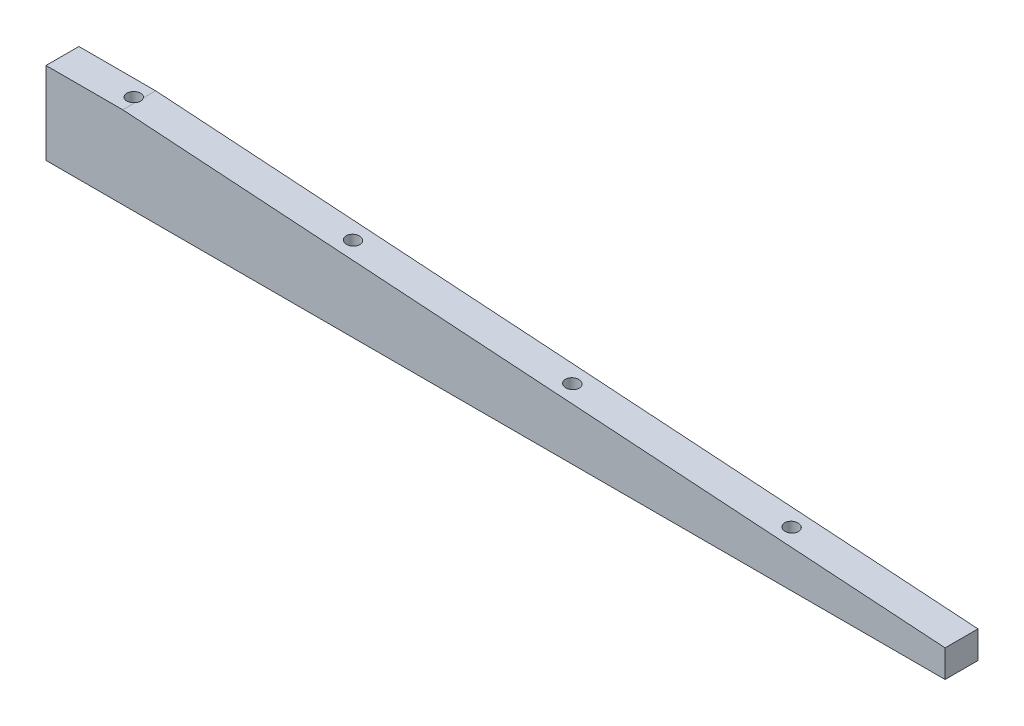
ISO-10303-21;
HEADER;
FILE_DESCRIPTION(('STEP AP214'),'2;1');
FILE_NAME('part.step','',(''),(''),'','','');
FILE_SCHEMA(('AUTOMOTIVE_DESIGN { 1 0 10303 214 1 1 1 1 }'));
ENDSEC;
DATA;
#1=APPLICATION_CONTEXT('core data for automotive mechanical design processes');
#2=APPLICATION_PROTOCOL_DEFINITION('international standard','automotive_design',2000,#1);
#3=PRODUCT_CONTEXT('',#1,'mechanical');
#4=PRODUCT('Part','Part','',(#3));
#5=PRODUCT_RELATED_PRODUCT_CATEGORY('part','',(#4));
#6=PRODUCT_DEFINITION_FORMATION('','',#4);
#7=PRODUCT_DEFINITION_CONTEXT('part definition',#1,'design');
#8=PRODUCT_DEFINITION('design','',#6,#7);
#9=PRODUCT_DEFINITION_SHAPE('','',#8);
#10=(LENGTH_UNIT() NAMED_UNIT(*) SI_UNIT(.MILLI.,.METRE.));
#11=(NAMED_UNIT(*) PLANE_ANGLE_UNIT() SI_UNIT($,.RADIAN.));
#12=(NAMED_UNIT(*) SI_UNIT($,.STERADIAN.) SOLID_ANGLE_UNIT());
#13=UNCERTAINTY_MEASURE_WITH_UNIT(LENGTH_MEASURE(1.E-05),#10,'distance_accuracy_value','');
#14=(GEOMETRIC_REPRESENTATION_CONTEXT(3) GLOBAL_UNCERTAINTY_ASSIGNED_CONTEXT((#13)) GLOBAL_UNIT_ASSIGNED_CONTEXT((#10,
#11,#12)) REPRESENTATION_CONTEXT('',''));
#15=CARTESIAN_POINT('',(0.,0.,0.));
#16=DIRECTION('',(0.,0.,1.));
#17=DIRECTION('',(1.,0.,0.));
#18=AXIS2_PLACEMENT_3D('',#15,#16,#17);
#19=CARTESIAN_POINT('',(-164.,-4.49987269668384E-12,12.));
#20=DIRECTION('',(1.,0.,0.));
#21=DIRECTION('',(0.,0.,-1.));
#22=AXIS2_PLACEMENT_3D('',#19,#20,#21);
#23=PLANE('',#22);
#24=CARTESIAN_POINT('',(-164.,21.9999999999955,6.));
#25=DIRECTION('',(-1.,0.,0.));
#26=DIRECTION('',(0.,0.,1.));
#27=AXIS2_PLACEMENT_3D('',#24,#25,#26);
#28=CIRCLE('',#27,2.5);
#29=CARTESIAN_POINT('',(-164.,21.9999999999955,8.5));
#30=VERTEX_POINT('',#29);
#31=EDGE_CURVE('E139',#30,#30,#28,.T.);
#32=ORIENTED_EDGE('',*,*,#31,.F.);
#33=EDGE_LOOP('',(#32));
#34=FACE_BOUND('',#33,.T.);
#35=CARTESIAN_POINT('',(-164.,7.9999999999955,6.));
#36=DIRECTION('',(-1.,0.,0.));
#37=DIRECTION('',(0.,0.,1.));
#38=AXIS2_PLACEMENT_3D('',#35,#36,#37);
#39=CIRCLE('',#38,2.5);
#40=CARTESIAN_POINT('',(-164.,7.9999999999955,8.5));
#41=VERTEX_POINT('',#40);
#42=EDGE_CURVE('E145',#41,#41,#39,.T.);
#43=ORIENTED_EDGE('',*,*,#42,.F.);
#44=EDGE_LOOP('',(#43));
#45=FACE_BOUND('',#44,.T.);
#46=DIRECTION('',(0.,-1.,0.));
#47=VECTOR('',#46,1.);
#48=CARTESIAN_POINT('',(-164.,-4.49987269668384E-12,0.));
#49=LINE('',#48,#47);
#50=CARTESIAN_POINT('',(-164.,29.9999999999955,0.));
#51=VERTEX_POINT('',#50);
#52=CARTESIAN_POINT('',(-164.,-4.49987269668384E-12,0.));
#53=VERTEX_POINT('',#52);
#54=EDGE_CURVE('E103',#51,#53,#49,.T.);
#55=ORIENTED_EDGE('',*,*,#54,.T.);
#56=DIRECTION('',(0.,0.,-1.));
#57=VECTOR('',#56,1.);
#58=CARTESIAN_POINT('',(-164.,-4.49987269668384E-12,12.));
#59=LINE('',#58,#57);
#60=CARTESIAN_POINT('',(-164.,-4.49987269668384E-12,12.));
#61=VERTEX_POINT('',#60);
#62=EDGE_CURVE('E23',#61,#53,#59,.T.);
#63=ORIENTED_EDGE('',*,*,#62,.F.);
#64=DIRECTION('',(0.,-1.,0.));
#65=VECTOR('',#64,1.);
#66=CARTESIAN_POINT('',(-164.,-4.49987269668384E-12,12.));
#67=LINE('',#66,#65);
#68=CARTESIAN_POINT('',(-164.,29.9999999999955,12.));
#69=VERTEX_POINT('',#68);
#70=EDGE_CURVE('E113',#69,#61,#67,.T.);
#71=ORIENTED_EDGE('',*,*,#70,.F.);
#72=DIRECTION('',(0.,0.,-1.));
#73=VECTOR('',#72,1.);
#74=CARTESIAN_POINT('',(-164.,29.9999999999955,12.));
#75=LINE('',#74,#73);
#76=EDGE_CURVE('E99',#69,#51,#75,.T.);
#77=ORIENTED_EDGE('',*,*,#76,.T.);
#78=EDGE_LOOP('',(#55,#63,#71,#77));
#79=FACE_BOUND('',#78,.T.);
#80=ADVANCED_FACE('F16',(#34,#45,#79),#23,.F.);
#81=CARTESIAN_POINT('',(-164.,-4.49987269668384E-12,12.));
#82=DIRECTION('',(0.,1.,0.));
#83=DIRECTION('',(0.,0.,1.));
#84=AXIS2_PLACEMENT_3D('',#81,#82,#83);
#85=PLANE('',#84);
#86=CARTESIAN_POINT('',(-138.,0.,6.00000000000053));
#87=DIRECTION('',(0.,-1.,0.));
#88=DIRECTION('',(0.,0.,-1.));
#89=AXIS2_PLACEMENT_3D('',#86,#87,#88);
#90=CIRCLE('',#89,2.5);
#91=CARTESIAN_POINT('',(-138.,0.,3.50000000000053));
#92=VERTEX_POINT('',#91);
#93=EDGE_CURVE('E305',#92,#92,#90,.T.);
#94=ORIENTED_EDGE('',*,*,#93,.F.);
#95=EDGE_LOOP('',(#94));
#96=FACE_BOUND('',#95,.T.);
#97=CARTESIAN_POINT('',(-58.,0.,6.00000000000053));
#98=DIRECTION('',(0.,-1.,0.));
#99=DIRECTION('',(0.,0.,-1.));
#100=AXIS2_PLACEMENT_3D('',#97,#98,#99);
#101=CIRCLE('',#100,2.5);
#102=CARTESIAN_POINT('',(-58.,0.,3.50000000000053));
#103=VERTEX_POINT('',#102);
#104=EDGE_CURVE('E133',#103,#103,#101,.T.);
#105=ORIENTED_EDGE('',*,*,#104,.F.);
#106=EDGE_LOOP('',(#105));
#107=FACE_BOUND('',#106,.T.);
#108=CARTESIAN_POINT('',(22.,0.,6.00000000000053));
#109=DIRECTION('',(0.,-1.,0.));
#110=DIRECTION('',(0.,0.,-1.));
#111=AXIS2_PLACEMENT_3D('',#108,#109,#110);
#112=CIRCLE('',#111,2.5);
#113=CARTESIAN_POINT('',(22.,0.,3.50000000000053));
#114=VERTEX_POINT('',#113);
#115=EDGE_CURVE('E121',#114,#114,#112,.T.);
#116=ORIENTED_EDGE('',*,*,#115,.F.);
#117=EDGE_LOOP('',(#116));
#118=FACE_BOUND('',#117,.T.);
#119=CARTESIAN_POINT('',(102.,0.,6.00000000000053));
#120=DIRECTION('',(0.,-1.,0.));
#121=DIRECTION('',(0.,0.,-1.));
#122=AXIS2_PLACEMENT_3D('',#119,#120,#121);
#123=CIRCLE('',#122,2.5);
#124=CARTESIAN_POINT('',(102.,0.,3.50000000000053));
#125=VERTEX_POINT('',#124);
#126=EDGE_CURVE('E120',#125,#125,#123,.T.);
#127=ORIENTED_EDGE('',*,*,#126,.F.);
#128=EDGE_LOOP('',(#127));
#129=FACE_BOUND('',#128,.T.);
#130=DIRECTION('',(1.,0.,0.));
#131=VECTOR('',#130,1.);
#132=CARTESIAN_POINT('',(-164.,-4.49987269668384E-12,0.));
#133=LINE('',#132,#131);
#134=CARTESIAN_POINT('',(164.,-4.49987269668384E-12,0.));
#135=VERTEX_POINT('',#134);
#136=EDGE_CURVE('E106',#53,#135,#133,.T.);
#137=ORIENTED_EDGE('',*,*,#136,.T.);
#138=DIRECTION('',(0.,0.,-1.));
#139=VECTOR('',#138,1.);
#140=CARTESIAN_POINT('',(164.,-4.49987269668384E-12,12.));
#141=LINE('',#140,#139);
#142=CARTESIAN_POINT('',(164.,-4.49987269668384E-12,12.));
#143=VERTEX_POINT('',#142);
#144=EDGE_CURVE('E92',#143,#135,#141,.T.);
#145=ORIENTED_EDGE('',*,*,#144,.F.);
#146=DIRECTION('',(1.,0.,0.));
#147=VECTOR('',#146,1.);
#148=CARTESIAN_POINT('',(-164.,-4.49987269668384E-12,12.));
#149=LINE('',#148,#147);
#150=EDGE_CURVE('E69',#61,#143,#149,.T.);
#151=ORIENTED_EDGE('',*,*,#150,.F.);
#152=ORIENTED_EDGE('',*,*,#62,.T.);
#153=EDGE_LOOP('',(#137,#145,#151,#152));
#154=FACE_BOUND('',#153,.T.);
#155=ADVANCED_FACE('F154',(#96,#107,#118,#129,#154),#85,.F.);
#156=CARTESIAN_POINT('',(164.,-4.49987269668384E-12,12.));
#157=DIRECTION('',(-1.,0.,0.));
#158=DIRECTION('',(0.,0.,1.));
#159=AXIS2_PLACEMENT_3D('',#156,#157,#158);
#160=PLANE('',#159);
#161=DIRECTION('',(0.,1.,0.));
#162=VECTOR('',#161,1.);
#163=CARTESIAN_POINT('',(164.,-4.49987269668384E-12,0.));
#164=LINE('',#163,#162);
#165=CARTESIAN_POINT('',(164.,9.9999999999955,0.));
#166=VERTEX_POINT('',#165);
#167=EDGE_CURVE('E88',#135,#166,#164,.T.);
#168=ORIENTED_EDGE('',*,*,#167,.T.);
#169=DIRECTION('',(0.,0.,-1.));
#170=VECTOR('',#169,1.);
#171=CARTESIAN_POINT('',(164.,9.9999999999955,12.));
#172=LINE('',#171,#170);
#173=CARTESIAN_POINT('',(164.,9.9999999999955,12.));
#174=VERTEX_POINT('',#173);
#175=EDGE_CURVE('E85',#174,#166,#172,.T.);
#176=ORIENTED_EDGE('',*,*,#175,.F.);
#177=DIRECTION('',(0.,1.,0.));
#178=VECTOR('',#177,1.);
#179=CARTESIAN_POINT('',(164.,-4.49987269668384E-12,12.));
#180=LINE('',#179,#178);
#181=EDGE_CURVE('E75',#143,#174,#180,.T.);
#182=ORIENTED_EDGE('',*,*,#181,.F.);
#183=ORIENTED_EDGE('',*,*,#144,.T.);
#184=EDGE_LOOP('',(#168,#176,#182,#183));
#185=FACE_BOUND('',#184,.T.);
#186=ADVANCED_FACE('F86',(#185),#160,.F.);
#187=CARTESIAN_POINT('',(164.,9.9999999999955,12.));
#188=DIRECTION('',(-0.0665190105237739,-0.997785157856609,0.));
#189=DIRECTION('',(0.997785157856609,-0.0665190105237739,0.));
#190=AXIS2_PLACEMENT_3D('',#187,#188,#189);
#191=PLANE('',#190);
#192=CARTESIAN_POINT('',(-58.,24.7999999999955,6.00000000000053));
#193=DIRECTION('',(-0.0665190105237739,-0.997785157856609,0.));
#194=DIRECTION('',(0.997785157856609,-0.0665190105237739,0.));
#195=AXIS2_PLACEMENT_3D('',#192,#193,#194);
#196=ELLIPSE('',#195,2.50554939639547,2.5);
#197=CARTESIAN_POINT('',(-55.5,24.6333333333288,6.00000000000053));
#198=VERTEX_POINT('',#197);
#199=EDGE_CURVE('E128',#198,#198,#196,.T.);
#200=ORIENTED_EDGE('',*,*,#199,.T.);
#201=EDGE_LOOP('',(#200));
#202=FACE_BOUND('',#201,.T.);
#203=CARTESIAN_POINT('',(22.,19.4666666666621,6.00000000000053));
#204=DIRECTION('',(-0.0665190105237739,-0.997785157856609,0.));
#205=DIRECTION('',(0.997785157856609,-0.0665190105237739,0.));
#206=AXIS2_PLACEMENT_3D('',#203,#204,#205);
#207=ELLIPSE('',#206,2.50554939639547,2.5);
#208=CARTESIAN_POINT('',(24.5,19.2999999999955,6.00000000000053));
#209=VERTEX_POINT('',#208);
#210=EDGE_CURVE('E118',#209,#209,#207,.T.);
#211=ORIENTED_EDGE('',*,*,#210,.T.);
#212=EDGE_LOOP('',(#211));
#213=FACE_BOUND('',#212,.T.);
#214=CARTESIAN_POINT('',(102.,14.1333333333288,6.00000000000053));
#215=DIRECTION('',(-0.0665190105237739,-0.997785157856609,0.));
#216=DIRECTION('',(0.997785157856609,-0.0665190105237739,0.));
#217=AXIS2_PLACEMENT_3D('',#214,#215,#216);
#218=ELLIPSE('',#217,2.50554939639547,2.5);
#219=CARTESIAN_POINT('',(104.5,13.9666666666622,6.00000000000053));
#220=VERTEX_POINT('',#219);
#221=EDGE_CURVE('E125',#220,#220,#218,.T.);
#222=ORIENTED_EDGE('',*,*,#221,.T.);
#223=EDGE_LOOP('',(#222));
#224=FACE_BOUND('',#223,.T.);
#225=DIRECTION('',(0.,0.,-1.));
#226=VECTOR('',#225,1.);
#227=CARTESIAN_POINT('',(-136.,29.9999999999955,12.));
#228=LINE('',#227,#226);
#229=CARTESIAN_POINT('',(-136.,29.9999999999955,4.50000000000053));
#230=VERTEX_POINT('',#229);
#231=CARTESIAN_POINT('',(-136.,29.9999999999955,0.));
#232=VERTEX_POINT('',#231);
#233=EDGE_CURVE('E115',#230,#232,#228,.T.);
#234=ORIENTED_EDGE('',*,*,#233,.F.);
#235=CARTESIAN_POINT('',(-138.,30.1333333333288,6.00000000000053));
#236=DIRECTION('',(-0.0665190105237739,-0.997785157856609,0.));
#237=DIRECTION('',(0.997785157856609,-0.0665190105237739,0.));
#238=AXIS2_PLACEMENT_3D('',#235,#236,#237);
#239=ELLIPSE('',#238,2.50554939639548,2.5);
#240=CARTESIAN_POINT('',(-136.,29.9999999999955,7.50000000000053));
#241=VERTEX_POINT('',#240);
#242=EDGE_CURVE('E29',#230,#241,#239,.T.);
#243=ORIENTED_EDGE('',*,*,#242,.T.);
#244=CARTESIAN_POINT('',(-136.,29.9999999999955,12.));
#245=VERTEX_POINT('',#244);
#246=EDGE_CURVE('E93',#245,#241,#228,.T.);
#247=ORIENTED_EDGE('',*,*,#246,.F.);
#248=DIRECTION('',(-0.997785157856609,0.0665190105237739,0.));
#249=VECTOR('',#248,1.);
#250=CARTESIAN_POINT('',(164.,9.9999999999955,12.));
#251=LINE('',#250,#249);
#252=EDGE_CURVE('E79',#174,#245,#251,.T.);
#253=ORIENTED_EDGE('',*,*,#252,.F.);
#254=ORIENTED_EDGE('',*,*,#175,.T.);
#255=DIRECTION('',(-0.997785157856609,0.0665190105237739,0.));
#256=VECTOR('',#255,1.);
#257=CARTESIAN_POINT('',(164.,9.9999999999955,0.));
#258=LINE('',#257,#256);
#259=EDGE_CURVE('E110',#166,#232,#258,.T.);
#260=ORIENTED_EDGE('',*,*,#259,.T.);
#261=EDGE_LOOP('',(#234,#243,#247,#253,#254,#260));
#262=FACE_BOUND('',#261,.T.);
#263=ADVANCED_FACE('F96',(#202,#213,#224,#262),#191,.F.);
#264=CARTESIAN_POINT('',(-164.,29.9999999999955,12.));
#265=DIRECTION('',(0.,-1.,0.));
#266=DIRECTION('',(0.,0.,-1.));
#267=AXIS2_PLACEMENT_3D('',#264,#265,#266);
#268=PLANE('',#267);
#269=ORIENTED_EDGE('',*,*,#246,.T.);
#270=CARTESIAN_POINT('',(-138.,29.9999999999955,6.00000000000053));
#271=DIRECTION('',(0.,-1.,0.));
#272=DIRECTION('',(0.,0.,-1.));
#273=AXIS2_PLACEMENT_3D('',#270,#271,#272);
#274=CIRCLE('',#273,2.5);
#275=EDGE_CURVE('E11',#241,#230,#274,.T.);
#276=ORIENTED_EDGE('',*,*,#275,.T.);
#277=ORIENTED_EDGE('',*,*,#233,.T.);
#278=DIRECTION('',(-1.,0.,0.));
#279=VECTOR('',#278,1.);
#280=CARTESIAN_POINT('',(-164.,29.9999999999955,0.));
#281=LINE('',#280,#279);
#282=EDGE_CURVE('E60',#232,#51,#281,.T.);
#283=ORIENTED_EDGE('',*,*,#282,.T.);
#284=ORIENTED_EDGE('',*,*,#76,.F.);
#285=DIRECTION('',(-1.,0.,0.));
#286=VECTOR('',#285,1.);
#287=CARTESIAN_POINT('',(-164.,29.9999999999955,12.));
#288=LINE('',#287,#286);
#289=EDGE_CURVE('E37',#245,#69,#288,.T.);
#290=ORIENTED_EDGE('',*,*,#289,.F.);
#291=EDGE_LOOP('',(#269,#276,#277,#283,#284,#290));
#292=FACE_BOUND('',#291,.T.);
#293=ADVANCED_FACE('F158',(#292),#268,.F.);
#294=CARTESIAN_POINT('',(0.,0.,12.));
#295=DIRECTION('',(0.,0.,-1.));
#296=DIRECTION('',(-1.,0.,0.));
#297=AXIS2_PLACEMENT_3D('',#294,#295,#296);
#298=PLANE('',#297);
#299=ORIENTED_EDGE('',*,*,#70,.T.);
#300=ORIENTED_EDGE('',*,*,#150,.T.);
#301=ORIENTED_EDGE('',*,*,#181,.T.);
#302=ORIENTED_EDGE('',*,*,#252,.T.);
#303=ORIENTED_EDGE('',*,*,#289,.T.);
#304=EDGE_LOOP('',(#299,#300,#301,#302,#303));
#305=FACE_BOUND('',#304,.T.);
#306=ADVANCED_FACE('F77',(#305),#298,.F.);
#307=CARTESIAN_POINT('',(0.,0.,0.));
#308=DIRECTION('',(0.,0.,-1.));
#309=DIRECTION('',(-1.,0.,0.));
#310=AXIS2_PLACEMENT_3D('',#307,#308,#309);
#311=PLANE('',#310);
#312=ORIENTED_EDGE('',*,*,#54,.F.);
#313=ORIENTED_EDGE('',*,*,#282,.F.);
#314=ORIENTED_EDGE('',*,*,#259,.F.);
#315=ORIENTED_EDGE('',*,*,#167,.F.);
#316=ORIENTED_EDGE('',*,*,#136,.F.);
#317=EDGE_LOOP('',(#312,#313,#314,#315,#316));
#318=FACE_BOUND('',#317,.T.);
#319=ADVANCED_FACE('F156',(#318),#311,.T.);
#320=CARTESIAN_POINT('',(-149.,7.9999999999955,6.));
#321=DIRECTION('',(-1.,0.,0.));
#322=DIRECTION('',(0.,0.,1.));
#323=AXIS2_PLACEMENT_3D('',#320,#321,#322);
#324=CONICAL_SURFACE('',#323,2.5,1.02974425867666);
#325=CARTESIAN_POINT('',(-147.497848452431,7.9999999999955,6.));
#326=VERTEX_POINT('',#325);
#327=VERTEX_LOOP('',#326);
#328=FACE_BOUND('',#327,.T.);
#329=CARTESIAN_POINT('',(-149.,7.9999999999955,6.));
#330=DIRECTION('',(-1.,0.,0.));
#331=DIRECTION('',(0.,0.,1.));
#332=AXIS2_PLACEMENT_3D('',#329,#330,#331);
#333=CIRCLE('',#332,2.5);
#334=CARTESIAN_POINT('',(-149.,7.9999999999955,8.5));
#335=VERTEX_POINT('',#334);
#336=EDGE_CURVE('E107',#335,#335,#333,.T.);
#337=ORIENTED_EDGE('',*,*,#336,.T.);
#338=EDGE_LOOP('',(#337));
#339=FACE_BOUND('',#338,.T.);
#340=ADVANCED_FACE('F166',(#328,#339),#324,.F.);
#341=CARTESIAN_POINT('',(-164.,7.9999999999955,6.));
#342=DIRECTION('',(-1.,0.,0.));
#343=DIRECTION('',(0.,0.,1.));
#344=AXIS2_PLACEMENT_3D('',#341,#342,#343);
#345=CYLINDRICAL_SURFACE('',#344,2.5);
#346=ORIENTED_EDGE('',*,*,#336,.F.);
#347=EDGE_LOOP('',(#346));
#348=FACE_BOUND('',#347,.T.);
#349=ORIENTED_EDGE('',*,*,#42,.T.);
#350=EDGE_LOOP('',(#349));
#351=FACE_BOUND('',#350,.T.);
#352=ADVANCED_FACE('F169',(#348,#351),#345,.F.);
#353=CARTESIAN_POINT('',(-149.,21.9999999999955,6.));
#354=DIRECTION('',(-1.,0.,0.));
#355=DIRECTION('',(0.,0.,1.));
#356=AXIS2_PLACEMENT_3D('',#353,#354,#355);
#357=CONICAL_SURFACE('',#356,2.5,1.02974425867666);
#358=CARTESIAN_POINT('',(-147.497848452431,21.9999999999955,6.));
#359=VERTEX_POINT('',#358);
#360=VERTEX_LOOP('',#359);
#361=FACE_BOUND('',#360,.T.);
#362=CARTESIAN_POINT('',(-149.,21.9999999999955,6.));
#363=DIRECTION('',(-1.,0.,0.));
#364=DIRECTION('',(0.,0.,1.));
#365=AXIS2_PLACEMENT_3D('',#362,#363,#364);
#366=CIRCLE('',#365,2.5);
#367=CARTESIAN_POINT('',(-149.,21.9999999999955,8.5));
#368=VERTEX_POINT('',#367);
#369=EDGE_CURVE('E142',#368,#368,#366,.T.);
#370=ORIENTED_EDGE('',*,*,#369,.T.);
#371=EDGE_LOOP('',(#370));
#372=FACE_BOUND('',#371,.T.);
#373=ADVANCED_FACE('F175',(#361,#372),#357,.F.);
#374=CARTESIAN_POINT('',(-164.,21.9999999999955,6.));
#375=DIRECTION('',(-1.,0.,0.));
#376=DIRECTION('',(0.,0.,1.));
#377=AXIS2_PLACEMENT_3D('',#374,#375,#376);
#378=CYLINDRICAL_SURFACE('',#377,2.5);
#379=ORIENTED_EDGE('',*,*,#369,.F.);
#380=EDGE_LOOP('',(#379));
#381=FACE_BOUND('',#380,.T.);
#382=ORIENTED_EDGE('',*,*,#31,.T.);
#383=EDGE_LOOP('',(#382));
#384=FACE_BOUND('',#383,.T.);
#385=ADVANCED_FACE('F189',(#381,#384),#378,.F.);
#386=CARTESIAN_POINT('',(102.,0.,6.00000000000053));
#387=DIRECTION('',(0.,-1.,0.));
#388=DIRECTION('',(0.,0.,-1.));
#389=AXIS2_PLACEMENT_3D('',#386,#387,#388);
#390=CYLINDRICAL_SURFACE('',#389,2.5);
#391=ORIENTED_EDGE('',*,*,#126,.T.);
#392=EDGE_LOOP('',(#391));
#393=FACE_BOUND('',#392,.T.);
#394=ORIENTED_EDGE('',*,*,#221,.F.);
#395=EDGE_LOOP('',(#394));
#396=FACE_BOUND('',#395,.T.);
#397=ADVANCED_FACE('F191',(#393,#396),#390,.F.);
#398=CARTESIAN_POINT('',(22.,0.,6.00000000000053));
#399=DIRECTION('',(0.,-1.,0.));
#400=DIRECTION('',(0.,0.,-1.));
#401=AXIS2_PLACEMENT_3D('',#398,#399,#400);
#402=CYLINDRICAL_SURFACE('',#401,2.5);
#403=ORIENTED_EDGE('',*,*,#115,.T.);
#404=EDGE_LOOP('',(#403));
#405=FACE_BOUND('',#404,.T.);
#406=ORIENTED_EDGE('',*,*,#210,.F.);
#407=EDGE_LOOP('',(#406));
#408=FACE_BOUND('',#407,.T.);
#409=ADVANCED_FACE('F199',(#405,#408),#402,.F.);
#410=CARTESIAN_POINT('',(-58.,0.,6.00000000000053));
#411=DIRECTION('',(0.,-1.,0.));
#412=DIRECTION('',(0.,0.,-1.));
#413=AXIS2_PLACEMENT_3D('',#410,#411,#412);
#414=CYLINDRICAL_SURFACE('',#413,2.5);
#415=ORIENTED_EDGE('',*,*,#104,.T.);
#416=EDGE_LOOP('',(#415));
#417=FACE_BOUND('',#416,.T.);
#418=ORIENTED_EDGE('',*,*,#199,.F.);
#419=EDGE_LOOP('',(#418));
#420=FACE_BOUND('',#419,.T.);
#421=ADVANCED_FACE('F280',(#417,#420),#414,.F.);
#422=CARTESIAN_POINT('',(-138.,0.,6.00000000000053));
#423=DIRECTION('',(0.,-1.,0.));
#424=DIRECTION('',(0.,0.,-1.));
#425=AXIS2_PLACEMENT_3D('',#422,#423,#424);
#426=CYLINDRICAL_SURFACE('',#425,2.5);
#427=ORIENTED_EDGE('',*,*,#93,.T.);
#428=EDGE_LOOP('',(#427));
#429=FACE_BOUND('',#428,.T.);
#430=ORIENTED_EDGE('',*,*,#275,.F.);
#431=ORIENTED_EDGE('',*,*,#242,.F.);
#432=EDGE_LOOP('',(#430,#431));
#433=FACE_BOUND('',#432,.T.);
#434=ADVANCED_FACE('F159',(#429,#433),#426,.F.);
#435=CLOSED_SHELL('',(#80,#155,#186,#263,#293,#306,#319,#340,#352,#373,#385,#397,#409,#421,#434));
#436=MANIFOLD_SOLID_BREP('B1',#435);
#437=ADVANCED_BREP_SHAPE_REPRESENTATION('',(#18,#436),#14);
#438=SHAPE_DEFINITION_REPRESENTATION(#9,#437);
ENDSEC;
END-ISO-10303-21;
